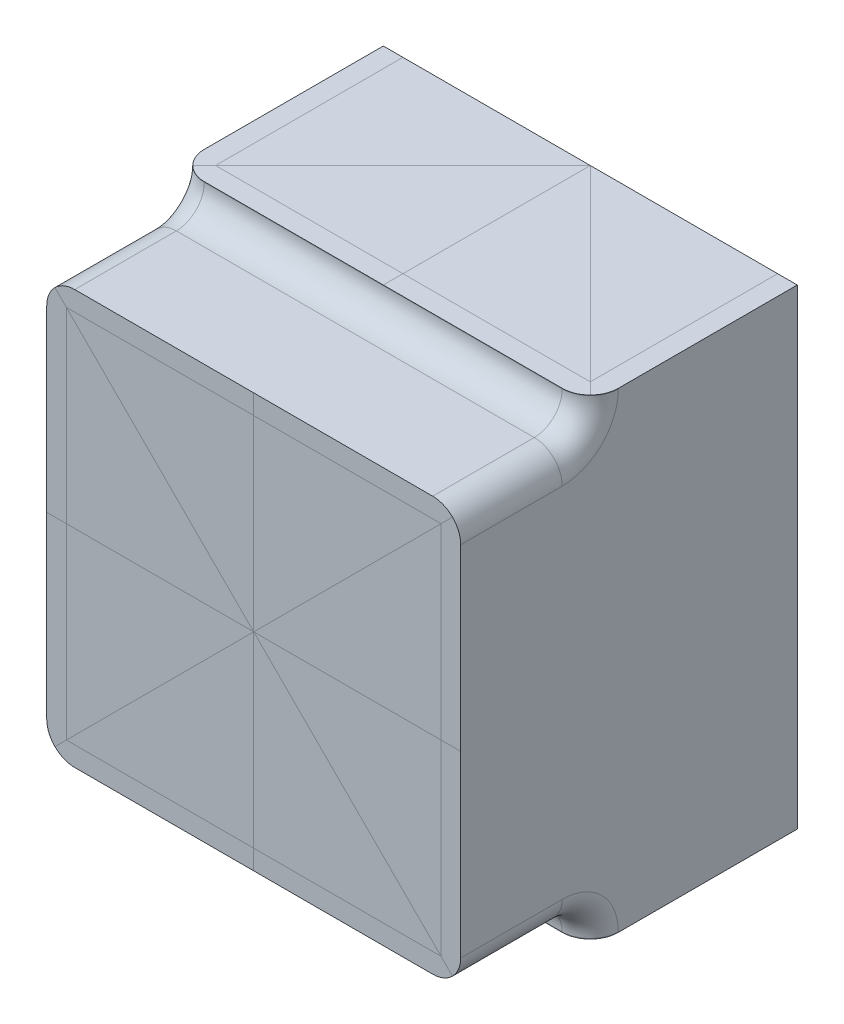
from build123d import *

# Parameters (mm, degrees)
SKETCH4_W             = 18450
SKETCH4_H             = 18450
BASEEXTRUS_DEPTH      = 15000
SKETCH5_W             = 18450
SKETCH5_H             = 9225
ARMEXTRUS_DEPTH       = 10500
INTERSECTION_RADIUS_R = 1249.4


with BuildPart() as part:
    # Sketch4 → BaseExtrus (new body)
    with BuildSketch(Plane(origin=(0, 0, 0), x_dir=(0, 1, 0), z_dir=(0, 0, 1))):
        Rectangle(SKETCH4_W, SKETCH4_H)
    extrude(amount=BASEEXTRUS_DEPTH)

    # Sketch5 → ArmExtrus (add, symmetric)
    with BuildSketch(Plane(origin=(0, 0, 0), x_dir=(-1, 0, 0), z_dir=(0, 1, 0))):
        with Locations((0, 4612.5)):
            Rectangle(SKETCH5_W, SKETCH5_H)
    extrude(amount=ARMEXTRUS_DEPTH, both=True)

    # Intersection Radius
    intersection_radius_edges = [part.edges().sort_by_distance(p)[0] for p in [
        (-9225, 9862.5, 9225),
        (0, 9225, 9225),
        (0, -9225, 9225),
        (-9225, -9862.5, 9225),
        (9225, 9862.5, 9225),
        (9225, -9862.5, 9225),
        (9225, 9225, 12112.5),
        (9225, -9225, 12112.5),
        (-9225, -9225, 12112.5),
        (-9225, 9225, 12112.5),
    ]]
    fillet(intersection_radius_edges, radius=INTERSECTION_RADIUS_R)


solid = part.part
